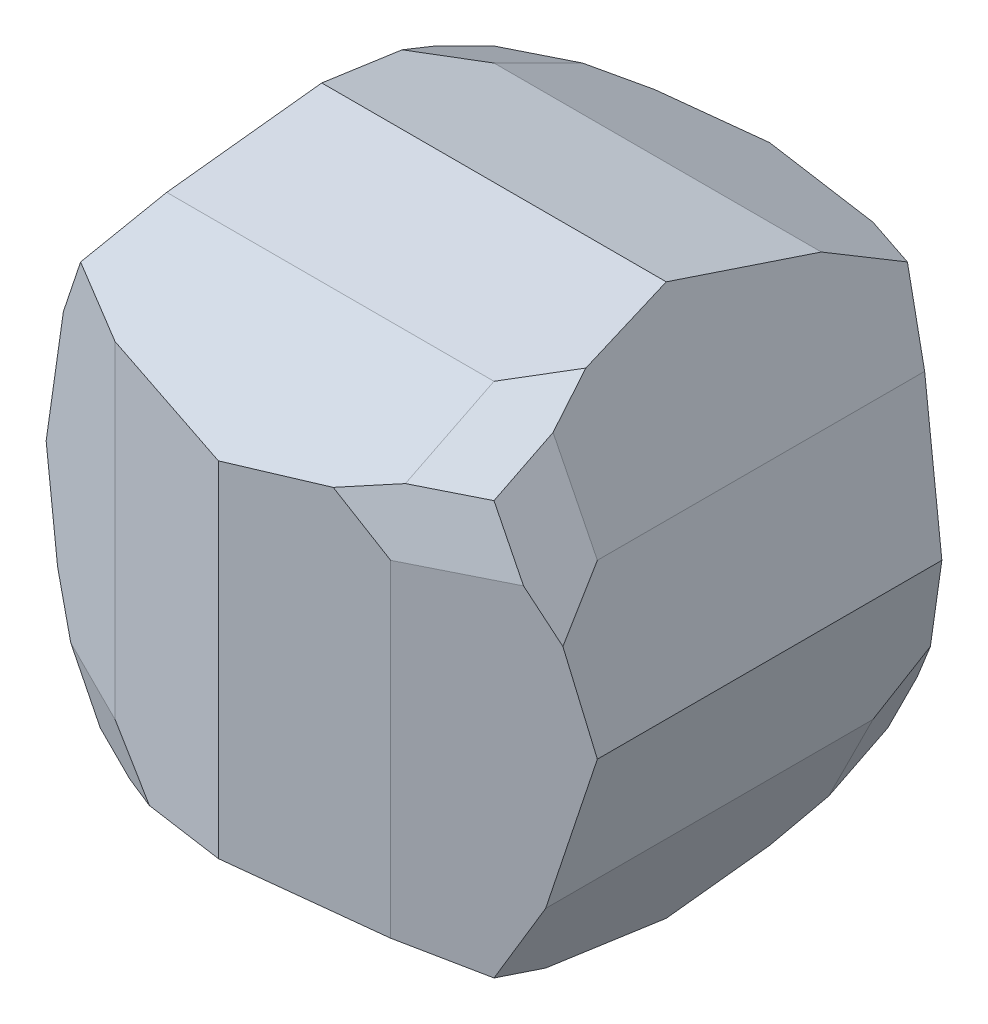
ISO-10303-21;
HEADER;
FILE_DESCRIPTION(('STEP AP214'),'2;1');
FILE_NAME('part.step','',(''),(''),'','','');
FILE_SCHEMA(('AUTOMOTIVE_DESIGN { 1 0 10303 214 1 1 1 1 }'));
ENDSEC;
DATA;
#1=APPLICATION_CONTEXT('core data for automotive mechanical design processes');
#2=APPLICATION_PROTOCOL_DEFINITION('international standard','automotive_design',2000,#1);
#3=PRODUCT_CONTEXT('',#1,'mechanical');
#4=PRODUCT('Part','Part','',(#3));
#5=PRODUCT_RELATED_PRODUCT_CATEGORY('part','',(#4));
#6=PRODUCT_DEFINITION_FORMATION('','',#4);
#7=PRODUCT_DEFINITION_CONTEXT('part definition',#1,'design');
#8=PRODUCT_DEFINITION('design','',#6,#7);
#9=PRODUCT_DEFINITION_SHAPE('','',#8);
#10=(LENGTH_UNIT() NAMED_UNIT(*) SI_UNIT(.MILLI.,.METRE.));
#11=(NAMED_UNIT(*) PLANE_ANGLE_UNIT() SI_UNIT($,.RADIAN.));
#12=(NAMED_UNIT(*) SI_UNIT($,.STERADIAN.) SOLID_ANGLE_UNIT());
#13=UNCERTAINTY_MEASURE_WITH_UNIT(LENGTH_MEASURE(1.E-05),#10,'distance_accuracy_value','');
#14=(GEOMETRIC_REPRESENTATION_CONTEXT(3) GLOBAL_UNCERTAINTY_ASSIGNED_CONTEXT((#13)) GLOBAL_UNIT_ASSIGNED_CONTEXT((#10,
#11,#12)) REPRESENTATION_CONTEXT('',''));
#15=CARTESIAN_POINT('',(0.,0.,0.));
#16=DIRECTION('',(0.,0.,1.));
#17=DIRECTION('',(1.,0.,0.));
#18=AXIS2_PLACEMENT_3D('',#15,#16,#17);
#19=CARTESIAN_POINT('',(-19.9999999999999,-20.0000000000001,0.));
#20=DIRECTION('',(-0.218217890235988,-0.872871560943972,0.436435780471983));
#21=DIRECTION('',(0.,0.447213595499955,0.894427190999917));
#22=AXIS2_PLACEMENT_3D('',#19,#20,#21);
#23=PLANE('',#22);
#24=DIRECTION('',(0.894427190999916,0.,0.447213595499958));
#25=VECTOR('',#24,1.);
#26=CARTESIAN_POINT('',(-0.571428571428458,-14.2857142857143,21.1428571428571));
#27=LINE('',#26,#25);
#28=CARTESIAN_POINT('',(-14.2857142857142,-14.2857142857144,14.2857142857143));
#29=VERTEX_POINT('',#28);
#30=CARTESIAN_POINT('',(-9.99999999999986,-14.2857142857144,16.4285714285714));
#31=VERTEX_POINT('',#30);
#32=EDGE_CURVE('E356',#29,#31,#27,.T.);
#33=ORIENTED_EDGE('',*,*,#32,.F.);
#34=DIRECTION('',(0.,-0.447213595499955,-0.894427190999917));
#35=VECTOR('',#34,1.);
#36=CARTESIAN_POINT('',(-14.2857142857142,-21.1428571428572,0.571428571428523));
#37=LINE('',#36,#35);
#38=CARTESIAN_POINT('',(-14.2857142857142,-16.4285714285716,9.99999999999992));
#39=VERTEX_POINT('',#38);
#40=EDGE_CURVE('E473',#29,#39,#37,.T.);
#41=ORIENTED_EDGE('',*,*,#40,.T.);
#42=DIRECTION('',(0.240771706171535,-0.481543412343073,-0.842700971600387));
#43=VECTOR('',#42,1.);
#44=CARTESIAN_POINT('',(-12.1739130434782,-20.6521739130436,2.60869565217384));
#45=LINE('',#44,#43);
#46=CARTESIAN_POINT('',(-13.3333333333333,-18.3333333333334,6.66666666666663));
#47=VERTEX_POINT('',#46);
#48=EDGE_CURVE('E357',#39,#47,#45,.T.);
#49=ORIENTED_EDGE('',*,*,#48,.T.);
#50=DIRECTION('',(-0.696310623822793,-0.174077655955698,-0.69631062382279));
#51=VECTOR('',#50,1.);
#52=CARTESIAN_POINT('',(-19.9999999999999,-20.0000000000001,0.));
#53=LINE('',#52,#51);
#54=CARTESIAN_POINT('',(-9.9999999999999,-17.5000000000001,9.99999999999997));
#55=VERTEX_POINT('',#54);
#56=EDGE_CURVE('E385',#55,#47,#53,.T.);
#57=ORIENTED_EDGE('',*,*,#56,.F.);
#58=DIRECTION('',(0.,-0.447213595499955,-0.894427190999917));
#59=VECTOR('',#58,1.);
#60=CARTESIAN_POINT('',(-9.99999999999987,-12.5000000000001,20.0000000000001));
#61=LINE('',#60,#59);
#62=EDGE_CURVE('E384',#31,#55,#61,.T.);
#63=ORIENTED_EDGE('',*,*,#62,.F.);
#64=EDGE_LOOP('',(#33,#41,#49,#57,#63));
#65=FACE_BOUND('',#64,.T.);
#66=ADVANCED_FACE('F57',(#65),#23,.T.);
#67=CARTESIAN_POINT('',(1.36189806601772E-13,-20.,20.));
#68=DIRECTION('',(-0.436435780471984,-0.218217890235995,0.872871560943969));
#69=DIRECTION('',(-0.894427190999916,0.,-0.447213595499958));
#70=AXIS2_PLACEMENT_3D('',#67,#68,#69);
#71=PLANE('',#70);
#72=DIRECTION('',(0.894427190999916,0.,0.447213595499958));
#73=VECTOR('',#72,1.);
#74=CARTESIAN_POINT('',(-20.,-10.0000000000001,12.5));
#75=LINE('',#74,#73);
#76=CARTESIAN_POINT('',(-16.4285714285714,-10.0000000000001,14.2857142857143));
#77=VERTEX_POINT('',#76);
#78=CARTESIAN_POINT('',(-9.99999999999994,-10.0000000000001,17.5));
#79=VERTEX_POINT('',#78);
#80=EDGE_CURVE('E389',#77,#79,#75,.T.);
#81=ORIENTED_EDGE('',*,*,#80,.F.);
#82=DIRECTION('',(0.44721359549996,-0.894427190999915,0.));
#83=VECTOR('',#82,1.);
#84=CARTESIAN_POINT('',(-9.14285714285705,-24.5714285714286,14.2857142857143));
#85=LINE('',#84,#83);
#86=EDGE_CURVE('E483',#77,#29,#85,.T.);
#87=ORIENTED_EDGE('',*,*,#86,.T.);
#88=ORIENTED_EDGE('',*,*,#32,.T.);
#89=DIRECTION('',(0.842700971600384,0.240771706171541,0.481543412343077));
#90=VECTOR('',#89,1.);
#91=CARTESIAN_POINT('',(-2.60869565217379,-12.1739130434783,20.6521739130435));
#92=LINE('',#91,#90);
#93=CARTESIAN_POINT('',(-6.66666666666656,-13.3333333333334,18.3333333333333));
#94=VERTEX_POINT('',#93);
#95=EDGE_CURVE('E480',#31,#94,#92,.T.);
#96=ORIENTED_EDGE('',*,*,#95,.T.);
#97=DIRECTION('',(0.696310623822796,-0.696310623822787,0.174077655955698));
#98=VECTOR('',#97,1.);
#99=CARTESIAN_POINT('',(1.27831593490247E-13,-20.,20.));
#100=LINE('',#99,#98);
#101=EDGE_CURVE('E390',#79,#94,#100,.T.);
#102=ORIENTED_EDGE('',*,*,#101,.F.);
#103=EDGE_LOOP('',(#81,#87,#88,#96,#102));
#104=FACE_BOUND('',#103,.T.);
#105=ADVANCED_FACE('F685',(#104),#71,.T.);
#106=CARTESIAN_POINT('',(-19.9999999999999,-1.33136693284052E-13,20.0000000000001));
#107=DIRECTION('',(-0.872871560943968,-0.436435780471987,0.218217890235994));
#108=DIRECTION('',(0.447213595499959,-0.894427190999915,0.));
#109=AXIS2_PLACEMENT_3D('',#106,#107,#108);
#110=PLANE('',#109);
#111=DIRECTION('',(0.48154341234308,-0.842700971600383,0.240771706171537));
#112=VECTOR('',#111,1.);
#113=CARTESIAN_POINT('',(-29.6376811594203,13.1159420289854,7.68115942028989));
#114=LINE('',#113,#112);
#115=CARTESIAN_POINT('',(-18.3333333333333,-6.66666666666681,13.3333333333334));
#116=VERTEX_POINT('',#115);
#117=EDGE_CURVE('E485',#116,#77,#114,.T.);
#118=ORIENTED_EDGE('',*,*,#117,.F.);
#119=DIRECTION('',(-0.174077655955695,0.696310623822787,0.696310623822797));
#120=VECTOR('',#119,1.);
#121=CARTESIAN_POINT('',(-19.9999999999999,-1.41494906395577E-13,20.0000000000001));
#122=LINE('',#121,#120);
#123=CARTESIAN_POINT('',(-17.4999999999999,-10.0000000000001,10.));
#124=VERTEX_POINT('',#123);
#125=EDGE_CURVE('E450',#124,#116,#122,.T.);
#126=ORIENTED_EDGE('',*,*,#125,.F.);
#127=DIRECTION('',(-0.447213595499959,0.894427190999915,0.));
#128=VECTOR('',#127,1.);
#129=CARTESIAN_POINT('',(-12.4999999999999,-20.0000000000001,9.99999999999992));
#130=LINE('',#129,#128);
#131=EDGE_CURVE('E495',#39,#124,#130,.T.);
#132=ORIENTED_EDGE('',*,*,#131,.F.);
#133=ORIENTED_EDGE('',*,*,#40,.F.);
#134=ORIENTED_EDGE('',*,*,#86,.F.);
#135=EDGE_LOOP('',(#118,#126,#132,#133,#134));
#136=FACE_BOUND('',#135,.T.);
#137=ADVANCED_FACE('F693',(#136),#110,.T.);
#138=CARTESIAN_POINT('',(-19.9999999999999,-1.31401969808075E-13,20.0000000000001));
#139=DIRECTION('',(-0.970142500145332,-0.242535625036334,0.));
#140=DIRECTION('',(0.242535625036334,-0.970142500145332,0.));
#141=AXIS2_PLACEMENT_3D('',#138,#139,#140);
#142=PLANE('',#141);
#143=DIRECTION('',(-0.240771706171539,0.963086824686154,0.12038585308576));
#144=VECTOR('',#143,1.);
#145=CARTESIAN_POINT('',(-15.3623188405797,-18.5507246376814,-14.81884057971));
#146=LINE('',#145,#144);
#147=CARTESIAN_POINT('',(-17.5000000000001,-9.99999999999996,-13.7499999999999));
#148=VERTEX_POINT('',#147);
#149=CARTESIAN_POINT('',(-20.,-1.15923984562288E-13,-12.5));
#150=VERTEX_POINT('',#149);
#151=EDGE_CURVE('E152',#148,#150,#146,.T.);
#152=ORIENTED_EDGE('',*,*,#151,.F.);
#153=DIRECTION('',(0.,0.,-1.));
#154=VECTOR('',#153,1.);
#155=CARTESIAN_POINT('',(-17.5000000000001,-9.99999999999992,-20.));
#156=LINE('',#155,#154);
#157=EDGE_CURVE('E492',#124,#148,#156,.T.);
#158=ORIENTED_EDGE('',*,*,#157,.F.);
#159=ORIENTED_EDGE('',*,*,#125,.T.);
#160=DIRECTION('',(0.24077170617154,-0.963086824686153,0.120385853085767));
#161=VECTOR('',#160,1.);
#162=CARTESIAN_POINT('',(-24.6376811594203,18.5507246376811,10.1811594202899));
#163=LINE('',#162,#161);
#164=CARTESIAN_POINT('',(-20.0000000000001,-3.8740803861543E-13,12.5));
#165=VERTEX_POINT('',#164);
#166=EDGE_CURVE('E466',#165,#116,#163,.T.);
#167=ORIENTED_EDGE('',*,*,#166,.F.);
#168=DIRECTION('',(0.,0.,-1.));
#169=VECTOR('',#168,1.);
#170=CARTESIAN_POINT('',(-20.,-2.51653001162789E-13,-1.59872115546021E-13));
#171=LINE('',#170,#169);
#172=EDGE_CURVE('E309',#165,#150,#171,.T.);
#173=ORIENTED_EDGE('',*,*,#172,.T.);
#174=EDGE_LOOP('',(#152,#158,#159,#167,#173));
#175=FACE_BOUND('',#174,.T.);
#176=ADVANCED_FACE('F736',(#175),#142,.T.);
#177=CARTESIAN_POINT('',(-1.43128700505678E-13,19.9999999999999,-20.0000000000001));
#178=DIRECTION('',(-0.436435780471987,0.218217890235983,-0.872871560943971));
#179=DIRECTION('',(-0.894427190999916,0.,0.447213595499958));
#180=AXIS2_PLACEMENT_3D('',#177,#178,#179);
#181=PLANE('',#180);
#182=DIRECTION('',(0.894427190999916,0.,-0.447213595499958));
#183=VECTOR('',#182,1.);
#184=CARTESIAN_POINT('',(-20.0000000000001,9.99999999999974,-12.5));
#185=LINE('',#184,#183);
#186=CARTESIAN_POINT('',(-16.4285714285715,9.99999999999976,-14.2857142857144));
#187=VERTEX_POINT('',#186);
#188=CARTESIAN_POINT('',(-10.0000000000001,9.99999999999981,-17.5000000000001));
#189=VERTEX_POINT('',#188);
#190=EDGE_CURVE('E379',#187,#189,#185,.T.);
#191=ORIENTED_EDGE('',*,*,#190,.F.);
#192=DIRECTION('',(0.447213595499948,0.894427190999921,0.));
#193=VECTOR('',#192,1.);
#194=CARTESIAN_POINT('',(-9.14285714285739,24.5714285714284,-14.2857142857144));
#195=LINE('',#194,#193);
#196=CARTESIAN_POINT('',(-14.2857142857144,14.2857142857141,-14.2857142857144));
#197=VERTEX_POINT('',#196);
#198=EDGE_CURVE('E509',#187,#197,#195,.T.);
#199=ORIENTED_EDGE('',*,*,#198,.T.);
#200=DIRECTION('',(0.894427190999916,0.,-0.447213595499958));
#201=VECTOR('',#200,1.);
#202=CARTESIAN_POINT('',(-0.571428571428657,14.2857142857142,-21.1428571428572));
#203=LINE('',#202,#201);
#204=CARTESIAN_POINT('',(-10.0000000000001,14.2857142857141,-16.4285714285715));
#205=VERTEX_POINT('',#204);
#206=EDGE_CURVE('E503',#197,#205,#203,.T.);
#207=ORIENTED_EDGE('',*,*,#206,.T.);
#208=DIRECTION('',(0.842700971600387,-0.240771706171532,-0.481543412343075));
#209=VECTOR('',#208,1.);
#210=CARTESIAN_POINT('',(-2.60869565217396,12.1739130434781,-20.6521739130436));
#211=LINE('',#210,#209);
#212=CARTESIAN_POINT('',(-6.66666666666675,13.3333333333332,-18.3333333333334));
#213=VERTEX_POINT('',#212);
#214=EDGE_CURVE('E506',#205,#213,#211,.T.);
#215=ORIENTED_EDGE('',*,*,#214,.T.);
#216=DIRECTION('',(0.696310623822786,0.696310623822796,-0.174077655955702));
#217=VECTOR('',#216,1.);
#218=CARTESIAN_POINT('',(-1.51486913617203E-13,19.9999999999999,-20.0000000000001));
#219=LINE('',#218,#217);
#220=EDGE_CURVE('E380',#189,#213,#219,.T.);
#221=ORIENTED_EDGE('',*,*,#220,.F.);
#222=EDGE_LOOP('',(#191,#199,#207,#215,#221));
#223=FACE_BOUND('',#222,.T.);
#224=ADVANCED_FACE('F642',(#223),#181,.T.);
#225=CARTESIAN_POINT('',(-20.0000000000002,19.9999999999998,-1.23144686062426E-13));
#226=DIRECTION('',(-0.218217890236,0.872871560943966,-0.436435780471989));
#227=DIRECTION('',(0.,-0.447213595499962,-0.894427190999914));
#228=AXIS2_PLACEMENT_3D('',#225,#226,#227);
#229=PLANE('',#228);
#230=ORIENTED_EDGE('',*,*,#206,.F.);
#231=DIRECTION('',(0.,0.447213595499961,0.894427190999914));
#232=VECTOR('',#231,1.);
#233=CARTESIAN_POINT('',(-14.2857142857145,21.142857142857,-0.571428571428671));
#234=LINE('',#233,#232);
#235=CARTESIAN_POINT('',(-14.2857142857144,16.4285714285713,-10.));
#236=VERTEX_POINT('',#235);
#237=EDGE_CURVE('E497',#197,#236,#234,.T.);
#238=ORIENTED_EDGE('',*,*,#237,.T.);
#239=DIRECTION('',(0.240771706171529,0.481543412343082,0.842700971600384));
#240=VECTOR('',#239,1.);
#241=CARTESIAN_POINT('',(-12.1739130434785,20.6521739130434,-2.60869565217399));
#242=LINE('',#241,#240);
#243=CARTESIAN_POINT('',(-13.3333333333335,18.3333333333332,-6.66666666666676));
#244=VERTEX_POINT('',#243);
#245=EDGE_CURVE('E500',#236,#244,#242,.T.);
#246=ORIENTED_EDGE('',*,*,#245,.T.);
#247=DIRECTION('',(-0.696310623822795,0.174077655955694,0.696310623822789));
#248=VECTOR('',#247,1.);
#249=CARTESIAN_POINT('',(-20.0000000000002,19.9999999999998,-1.3150289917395E-13));
#250=LINE('',#249,#248);
#251=CARTESIAN_POINT('',(-10.0000000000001,17.4999999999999,-10.0000000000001));
#252=VERTEX_POINT('',#251);
#253=EDGE_CURVE('E375',#252,#244,#250,.T.);
#254=ORIENTED_EDGE('',*,*,#253,.F.);
#255=DIRECTION('',(0.,0.447213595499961,0.894427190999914));
#256=VECTOR('',#255,1.);
#257=CARTESIAN_POINT('',(-10.,12.4999999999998,-20.0000000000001));
#258=LINE('',#257,#256);
#259=EDGE_CURVE('E374',#205,#252,#258,.T.);
#260=ORIENTED_EDGE('',*,*,#259,.F.);
#261=EDGE_LOOP('',(#230,#238,#246,#254,#260));
#262=FACE_BOUND('',#261,.T.);
#263=ADVANCED_FACE('F645',(#262),#229,.T.);
#264=CARTESIAN_POINT('',(-19.9999999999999,-2.85841067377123E-13,-20.0000000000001));
#265=DIRECTION('',(-0.872871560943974,0.436435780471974,-0.218217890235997));
#266=DIRECTION('',(0.447213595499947,0.894427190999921,0.));
#267=AXIS2_PLACEMENT_3D('',#264,#265,#266);
#268=PLANE('',#267);
#269=DIRECTION('',(0.481543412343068,0.842700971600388,-0.240771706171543));
#270=VECTOR('',#269,1.);
#271=CARTESIAN_POINT('',(-29.6376811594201,-13.1159420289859,-7.6811594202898));
#272=LINE('',#271,#270);
#273=CARTESIAN_POINT('',(-18.3333333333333,6.66666666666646,-13.3333333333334));
#274=VERTEX_POINT('',#273);
#275=EDGE_CURVE('E465',#274,#187,#272,.T.);
#276=ORIENTED_EDGE('',*,*,#275,.F.);
#277=DIRECTION('',(-0.174077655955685,-0.696310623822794,-0.696310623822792));
#278=VECTOR('',#277,1.);
#279=CARTESIAN_POINT('',(-19.9999999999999,-2.77482854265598E-13,-20.0000000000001));
#280=LINE('',#279,#278);
#281=CARTESIAN_POINT('',(-17.5000000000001,9.99999999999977,-10.0000000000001));
#282=VERTEX_POINT('',#281);
#283=EDGE_CURVE('E446',#282,#274,#280,.T.);
#284=ORIENTED_EDGE('',*,*,#283,.F.);
#285=DIRECTION('',(-0.447213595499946,-0.894427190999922,0.));
#286=VECTOR('',#285,1.);
#287=CARTESIAN_POINT('',(-12.5000000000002,19.9999999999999,-10.0000000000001));
#288=LINE('',#287,#286);
#289=EDGE_CURVE('E370',#236,#282,#288,.T.);
#290=ORIENTED_EDGE('',*,*,#289,.F.);
#291=ORIENTED_EDGE('',*,*,#237,.F.);
#292=ORIENTED_EDGE('',*,*,#198,.F.);
#293=EDGE_LOOP('',(#276,#284,#290,#291,#292));
#294=FACE_BOUND('',#293,.T.);
#295=ADVANCED_FACE('F528',(#294),#268,.T.);
#296=CARTESIAN_POINT('',(-19.9999999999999,-2.875757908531E-13,-20.0000000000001));
#297=DIRECTION('',(-0.970142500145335,0.242535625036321,0.));
#298=DIRECTION('',(0.24253562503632,0.970142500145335,0.));
#299=AXIS2_PLACEMENT_3D('',#296,#297,#298);
#300=PLANE('',#299);
#301=ORIENTED_EDGE('',*,*,#172,.F.);
#302=DIRECTION('',(0.240771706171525,0.963086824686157,0.120385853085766));
#303=VECTOR('',#302,1.);
#304=CARTESIAN_POINT('',(-20.9420289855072,-3.76811594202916,12.0289855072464));
#305=LINE('',#304,#303);
#306=CARTESIAN_POINT('',(-17.5000000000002,9.99999999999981,13.7499999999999));
#307=VERTEX_POINT('',#306);
#308=EDGE_CURVE('E160',#165,#307,#305,.T.);
#309=ORIENTED_EDGE('',*,*,#308,.T.);
#310=DIRECTION('',(0.,0.,1.));
#311=VECTOR('',#310,1.);
#312=CARTESIAN_POINT('',(-17.5000000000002,9.99999999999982,19.9999999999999));
#313=LINE('',#312,#311);
#314=EDGE_CURVE('E449',#282,#307,#313,.T.);
#315=ORIENTED_EDGE('',*,*,#314,.F.);
#316=ORIENTED_EDGE('',*,*,#283,.T.);
#317=DIRECTION('',(0.240771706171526,0.963086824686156,-0.120385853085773));
#318=VECTOR('',#317,1.);
#319=CARTESIAN_POINT('',(-24.63768115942,-18.5507246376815,-10.1811594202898));
#320=LINE('',#319,#318);
#321=EDGE_CURVE('E462',#150,#274,#320,.T.);
#322=ORIENTED_EDGE('',*,*,#321,.F.);
#323=EDGE_LOOP('',(#301,#309,#315,#316,#322));
#324=FACE_BOUND('',#323,.T.);
#325=ADVANCED_FACE('F525',(#324),#300,.T.);
#326=CARTESIAN_POINT('',(20.0000000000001,-12.5,19.9999999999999));
#327=DIRECTION('',(0.,-0.894427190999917,0.447213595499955));
#328=DIRECTION('',(0.,0.447213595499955,0.894427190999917));
#329=AXIS2_PLACEMENT_3D('',#326,#327,#328);
#330=PLANE('',#329);
#331=DIRECTION('',(1.,0.,0.));
#332=VECTOR('',#331,1.);
#333=CARTESIAN_POINT('',(20.0000000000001,-17.4999999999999,9.99999999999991));
#334=LINE('',#333,#332);
#335=CARTESIAN_POINT('',(13.7500000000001,-17.5,9.99999999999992));
#336=VERTEX_POINT('',#335);
#337=EDGE_CURVE('E381',#55,#336,#334,.T.);
#338=ORIENTED_EDGE('',*,*,#337,.T.);
#339=DIRECTION('',(0.218217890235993,0.436435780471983,0.87287156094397));
#340=VECTOR('',#339,1.);
#341=CARTESIAN_POINT('',(16.4285714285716,-12.1428571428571,20.7142857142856));
#342=LINE('',#341,#340);
#343=CARTESIAN_POINT('',(15.0000000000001,-15.,14.9999999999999));
#344=VERTEX_POINT('',#343);
#345=EDGE_CURVE('E414',#336,#344,#342,.T.);
#346=ORIENTED_EDGE('',*,*,#345,.T.);
#347=DIRECTION('',(-0.872871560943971,0.218217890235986,0.436435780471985));
#348=VECTOR('',#347,1.);
#349=CARTESIAN_POINT('',(16.4285714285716,-15.3571428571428,14.2857142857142));
#350=LINE('',#349,#348);
#351=CARTESIAN_POINT('',(10.,-13.75,17.5));
#352=VERTEX_POINT('',#351);
#353=EDGE_CURVE('E330',#344,#352,#350,.T.);
#354=ORIENTED_EDGE('',*,*,#353,.T.);
#355=DIRECTION('',(-0.963086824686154,0.120385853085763,0.240771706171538));
#356=VECTOR('',#355,1.);
#357=CARTESIAN_POINT('',(18.5507246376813,-14.8188405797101,15.3623188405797));
#358=LINE('',#357,#356);
#359=CARTESIAN_POINT('',(1.31453093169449E-13,-12.5,20.0000000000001));
#360=VERTEX_POINT('',#359);
#361=EDGE_CURVE('E224',#352,#360,#358,.T.);
#362=ORIENTED_EDGE('',*,*,#361,.T.);
#363=DIRECTION('',(0.963086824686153,0.120385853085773,0.240771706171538));
#364=VECTOR('',#363,1.);
#365=CARTESIAN_POINT('',(-0.869565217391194,-12.608695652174,19.7826086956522));
#366=LINE('',#365,#364);
#367=EDGE_CURVE('E432',#94,#360,#366,.T.);
#368=ORIENTED_EDGE('',*,*,#367,.F.);
#369=ORIENTED_EDGE('',*,*,#95,.F.);
#370=ORIENTED_EDGE('',*,*,#62,.T.);
#371=EDGE_LOOP('',(#338,#346,#354,#362,#368,#369,#370));
#372=FACE_BOUND('',#371,.T.);
#373=ADVANCED_FACE('F683',(#372),#330,.T.);
#374=CARTESIAN_POINT('',(-19.9999999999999,-20.0000000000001,0.));
#375=DIRECTION('',(0.,-0.970142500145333,0.24253562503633));
#376=DIRECTION('',(0.,0.24253562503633,0.970142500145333));
#377=AXIS2_PLACEMENT_3D('',#374,#375,#376);
#378=PLANE('',#377);
#379=DIRECTION('',(-1.,0.,0.));
#380=VECTOR('',#379,1.);
#381=CARTESIAN_POINT('',(0.,-20.,0.));
#382=LINE('',#381,#380);
#383=CARTESIAN_POINT('',(12.5000000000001,-20.,-2.42193418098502E-13));
#384=VERTEX_POINT('',#383);
#385=CARTESIAN_POINT('',(-12.5,-20.0000000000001,0.));
#386=VERTEX_POINT('',#385);
#387=EDGE_CURVE('E308',#384,#386,#382,.T.);
#388=ORIENTED_EDGE('',*,*,#387,.F.);
#389=DIRECTION('',(0.120385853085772,0.240771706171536,0.963086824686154));
#390=VECTOR('',#389,1.);
#391=CARTESIAN_POINT('',(12.0289855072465,-20.9420289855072,-3.76811594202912));
#392=LINE('',#391,#390);
#393=EDGE_CURVE('E331',#384,#336,#392,.T.);
#394=ORIENTED_EDGE('',*,*,#393,.T.);
#395=ORIENTED_EDGE('',*,*,#337,.F.);
#396=ORIENTED_EDGE('',*,*,#56,.T.);
#397=DIRECTION('',(0.120385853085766,-0.240771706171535,-0.963086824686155));
#398=VECTOR('',#397,1.);
#399=CARTESIAN_POINT('',(-12.6086956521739,-19.7826086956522,0.869565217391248));
#400=LINE('',#399,#398);
#401=EDGE_CURVE('E352',#47,#386,#400,.T.);
#402=ORIENTED_EDGE('',*,*,#401,.T.);
#403=EDGE_LOOP('',(#388,#394,#395,#396,#402));
#404=FACE_BOUND('',#403,.T.);
#405=ADVANCED_FACE('F702',(#404),#378,.T.);
#406=CARTESIAN_POINT('',(-12.5000000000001,-19.9999999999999,-20.));
#407=DIRECTION('',(-0.894427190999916,-0.447213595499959,0.));
#408=DIRECTION('',(0.447213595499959,-0.894427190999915,0.));
#409=AXIS2_PLACEMENT_3D('',#406,#407,#408);
#410=PLANE('',#409);
#411=DIRECTION('',(0.218217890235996,-0.436435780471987,0.872871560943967));
#412=VECTOR('',#411,1.);
#413=CARTESIAN_POINT('',(-15.3571428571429,-14.2857142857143,-16.4285714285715));
#414=LINE('',#413,#412);
#415=CARTESIAN_POINT('',(-15.,-15.0000000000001,-14.9999999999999));
#416=VERTEX_POINT('',#415);
#417=CARTESIAN_POINT('',(-13.75,-17.5,-10.));
#418=VERTEX_POINT('',#417);
#419=EDGE_CURVE('E410',#416,#418,#414,.T.);
#420=ORIENTED_EDGE('',*,*,#419,.T.);
#421=DIRECTION('',(0.120385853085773,-0.240771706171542,0.963086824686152));
#422=VECTOR('',#421,1.);
#423=CARTESIAN_POINT('',(-14.8188405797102,-15.3623188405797,-18.5507246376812));
#424=LINE('',#423,#422);
#425=EDGE_CURVE('E413',#418,#386,#424,.T.);
#426=ORIENTED_EDGE('',*,*,#425,.T.);
#427=ORIENTED_EDGE('',*,*,#401,.F.);
#428=ORIENTED_EDGE('',*,*,#48,.F.);
#429=ORIENTED_EDGE('',*,*,#131,.T.);
#430=ORIENTED_EDGE('',*,*,#157,.T.);
#431=DIRECTION('',(-0.436435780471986,0.872871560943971,0.218217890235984));
#432=VECTOR('',#431,1.);
#433=CARTESIAN_POINT('',(-14.2857142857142,-16.4285714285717,-15.3571428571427));
#434=LINE('',#433,#432);
#435=EDGE_CURVE('E368',#416,#148,#434,.T.);
#436=ORIENTED_EDGE('',*,*,#435,.F.);
#437=EDGE_LOOP('',(#420,#426,#427,#428,#429,#430,#436));
#438=FACE_BOUND('',#437,.T.);
#439=ADVANCED_FACE('F698',(#438),#410,.T.);
#440=CARTESIAN_POINT('',(1.37924530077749E-13,-20.,20.));
#441=DIRECTION('',(-0.242535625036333,0.,0.970142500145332));
#442=DIRECTION('',(-0.970142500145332,0.,-0.242535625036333));
#443=AXIS2_PLACEMENT_3D('',#440,#441,#442);
#444=PLANE('',#443);
#445=DIRECTION('',(0.,-1.,0.));
#446=VECTOR('',#445,1.);
#447=CARTESIAN_POINT('',(0.,0.,20.));
#448=LINE('',#447,#446);
#449=CARTESIAN_POINT('',(0.,12.5000000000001,20.));
#450=VERTEX_POINT('',#449);
#451=EDGE_CURVE('E305',#450,#360,#448,.T.);
#452=ORIENTED_EDGE('',*,*,#451,.F.);
#453=DIRECTION('',(-0.963086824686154,0.12038585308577,-0.240771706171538));
#454=VECTOR('',#453,1.);
#455=CARTESIAN_POINT('',(3.76811594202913,12.0289855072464,20.9420289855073));
#456=LINE('',#455,#454);
#457=CARTESIAN_POINT('',(-10.0000000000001,13.75,17.5));
#458=VERTEX_POINT('',#457);
#459=EDGE_CURVE('E409',#450,#458,#456,.T.);
#460=ORIENTED_EDGE('',*,*,#459,.T.);
#461=DIRECTION('',(0.,1.,0.));
#462=VECTOR('',#461,1.);
#463=CARTESIAN_POINT('',(-10.0000000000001,19.9999999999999,17.5));
#464=LINE('',#463,#462);
#465=EDGE_CURVE('E386',#79,#458,#464,.T.);
#466=ORIENTED_EDGE('',*,*,#465,.F.);
#467=ORIENTED_EDGE('',*,*,#101,.T.);
#468=ORIENTED_EDGE('',*,*,#367,.T.);
#469=EDGE_LOOP('',(#452,#460,#466,#467,#468));
#470=FACE_BOUND('',#469,.T.);
#471=ADVANCED_FACE('F678',(#470),#444,.T.);
#472=CARTESIAN_POINT('',(-20.0000000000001,19.9999999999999,12.5));
#473=DIRECTION('',(-0.447213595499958,0.,0.894427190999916));
#474=DIRECTION('',(-0.894427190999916,0.,-0.447213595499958));
#475=AXIS2_PLACEMENT_3D('',#472,#473,#474);
#476=PLANE('',#475);
#477=ORIENTED_EDGE('',*,*,#465,.T.);
#478=DIRECTION('',(-0.87287156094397,0.218217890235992,-0.436435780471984));
#479=VECTOR('',#478,1.);
#480=CARTESIAN_POINT('',(-20.7142857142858,16.4285714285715,12.1428571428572));
#481=LINE('',#480,#479);
#482=CARTESIAN_POINT('',(-15.0000000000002,15.0000000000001,15.));
#483=VERTEX_POINT('',#482);
#484=EDGE_CURVE('E406',#458,#483,#481,.T.);
#485=ORIENTED_EDGE('',*,*,#484,.T.);
#486=DIRECTION('',(0.436435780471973,0.872871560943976,0.218217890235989));
#487=VECTOR('',#486,1.);
#488=CARTESIAN_POINT('',(-12.1428571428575,20.7142857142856,16.4285714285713));
#489=LINE('',#488,#487);
#490=EDGE_CURVE('E365',#307,#483,#489,.T.);
#491=ORIENTED_EDGE('',*,*,#490,.F.);
#492=ORIENTED_EDGE('',*,*,#308,.F.);
#493=ORIENTED_EDGE('',*,*,#166,.T.);
#494=ORIENTED_EDGE('',*,*,#117,.T.);
#495=ORIENTED_EDGE('',*,*,#80,.T.);
#496=EDGE_LOOP('',(#477,#485,#491,#492,#493,#494,#495));
#497=FACE_BOUND('',#496,.T.);
#498=ADVANCED_FACE('F734',(#497),#476,.T.);
#499=CARTESIAN_POINT('',(19.9999999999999,12.5000000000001,-20.));
#500=DIRECTION('',(0.,0.894427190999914,-0.447213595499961));
#501=DIRECTION('',(0.,-0.447213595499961,-0.894427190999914));
#502=AXIS2_PLACEMENT_3D('',#499,#500,#501);
#503=PLANE('',#502);
#504=DIRECTION('',(-0.872871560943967,-0.218217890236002,-0.436435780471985));
#505=VECTOR('',#504,1.);
#506=CARTESIAN_POINT('',(16.4285714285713,15.357142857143,-14.2857142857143));
#507=LINE('',#506,#505);
#508=CARTESIAN_POINT('',(15.,15.0000000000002,-14.9999999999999));
#509=VERTEX_POINT('',#508);
#510=CARTESIAN_POINT('',(10.,13.7500000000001,-17.4999999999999));
#511=VERTEX_POINT('',#510);
#512=EDGE_CURVE('E399',#509,#511,#507,.T.);
#513=ORIENTED_EDGE('',*,*,#512,.T.);
#514=DIRECTION('',(-0.963086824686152,-0.120385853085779,-0.240771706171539));
#515=VECTOR('',#514,1.);
#516=CARTESIAN_POINT('',(18.550724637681,14.8188405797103,-15.3623188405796));
#517=LINE('',#516,#515);
#518=CARTESIAN_POINT('',(-2.47879059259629E-13,12.4999999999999,-20.));
#519=VERTEX_POINT('',#518);
#520=EDGE_CURVE('E402',#511,#519,#517,.T.);
#521=ORIENTED_EDGE('',*,*,#520,.T.);
#522=DIRECTION('',(0.963086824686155,-0.120385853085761,-0.240771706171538));
#523=VECTOR('',#522,1.);
#524=CARTESIAN_POINT('',(-0.86956521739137,12.6086956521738,-19.7826086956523));
#525=LINE('',#524,#523);
#526=EDGE_CURVE('E511',#213,#519,#525,.T.);
#527=ORIENTED_EDGE('',*,*,#526,.F.);
#528=ORIENTED_EDGE('',*,*,#214,.F.);
#529=ORIENTED_EDGE('',*,*,#259,.T.);
#530=DIRECTION('',(1.,0.,0.));
#531=VECTOR('',#530,1.);
#532=CARTESIAN_POINT('',(19.9999999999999,17.5000000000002,-10.));
#533=LINE('',#532,#531);
#534=CARTESIAN_POINT('',(13.75,17.5000000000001,-10.));
#535=VERTEX_POINT('',#534);
#536=EDGE_CURVE('E371',#252,#535,#533,.T.);
#537=ORIENTED_EDGE('',*,*,#536,.T.);
#538=DIRECTION('',(0.218217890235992,-0.436435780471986,-0.872871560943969));
#539=VECTOR('',#538,1.);
#540=CARTESIAN_POINT('',(16.4285714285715,12.1428571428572,-20.7142857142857));
#541=LINE('',#540,#539);
#542=EDGE_CURVE('E403',#535,#509,#541,.T.);
#543=ORIENTED_EDGE('',*,*,#542,.T.);
#544=EDGE_LOOP('',(#513,#521,#527,#528,#529,#537,#543));
#545=FACE_BOUND('',#544,.T.);
#546=ADVANCED_FACE('F640',(#545),#503,.T.);
#547=CARTESIAN_POINT('',(-1.41393977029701E-13,19.9999999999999,-20.0000000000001));
#548=DIRECTION('',(-0.242535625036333,0.,-0.970142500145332));
#549=DIRECTION('',(-0.970142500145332,0.,0.242535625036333));
#550=AXIS2_PLACEMENT_3D('',#547,#548,#549);
#551=PLANE('',#550);
#552=DIRECTION('',(0.,1.,0.));
#553=VECTOR('',#552,1.);
#554=CARTESIAN_POINT('',(0.,0.,-20.));
#555=LINE('',#554,#553);
#556=CARTESIAN_POINT('',(2.40940165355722E-13,-12.5,-20.));
#557=VERTEX_POINT('',#556);
#558=EDGE_CURVE('E313',#557,#519,#555,.T.);
#559=ORIENTED_EDGE('',*,*,#558,.F.);
#560=DIRECTION('',(-0.963086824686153,-0.120385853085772,0.240771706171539));
#561=VECTOR('',#560,1.);
#562=CARTESIAN_POINT('',(3.76811594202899,-12.0289855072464,-20.9420289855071));
#563=LINE('',#562,#561);
#564=CARTESIAN_POINT('',(-9.99999999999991,-13.75,-17.4999999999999));
#565=VERTEX_POINT('',#564);
#566=EDGE_CURVE('E628',#557,#565,#563,.T.);
#567=ORIENTED_EDGE('',*,*,#566,.T.);
#568=DIRECTION('',(0.,-1.,0.));
#569=VECTOR('',#568,1.);
#570=CARTESIAN_POINT('',(-9.99999999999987,-20.0000000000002,-17.4999999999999));
#571=LINE('',#570,#569);
#572=EDGE_CURVE('E376',#189,#565,#571,.T.);
#573=ORIENTED_EDGE('',*,*,#572,.F.);
#574=ORIENTED_EDGE('',*,*,#220,.T.);
#575=ORIENTED_EDGE('',*,*,#526,.T.);
#576=EDGE_LOOP('',(#559,#567,#573,#574,#575));
#577=FACE_BOUND('',#576,.T.);
#578=ADVANCED_FACE('F59',(#577),#551,.T.);
#579=CARTESIAN_POINT('',(-20.0000000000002,19.9999999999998,-1.21409962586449E-13));
#580=DIRECTION('',(0.,0.970142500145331,-0.242535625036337));
#581=DIRECTION('',(0.,-0.242535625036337,-0.970142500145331));
#582=AXIS2_PLACEMENT_3D('',#579,#580,#581);
#583=PLANE('',#582);
#584=DIRECTION('',(-1.,0.,0.));
#585=VECTOR('',#584,1.);
#586=CARTESIAN_POINT('',(-2.57342894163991E-13,20.,0.));
#587=LINE('',#586,#585);
#588=CARTESIAN_POINT('',(12.5000000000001,20.0000000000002,1.02534164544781E-13));
#589=VERTEX_POINT('',#588);
#590=CARTESIAN_POINT('',(-12.5000000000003,19.9999999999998,-2.73883482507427E-13));
#591=VERTEX_POINT('',#590);
#592=EDGE_CURVE('E316',#589,#591,#587,.T.);
#593=ORIENTED_EDGE('',*,*,#592,.F.);
#594=DIRECTION('',(0.120385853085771,-0.240771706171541,-0.963086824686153));
#595=VECTOR('',#594,1.);
#596=CARTESIAN_POINT('',(12.0289855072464,20.9420289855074,3.76811594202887));
#597=LINE('',#596,#595);
#598=EDGE_CURVE('E398',#589,#535,#597,.T.);
#599=ORIENTED_EDGE('',*,*,#598,.T.);
#600=ORIENTED_EDGE('',*,*,#536,.F.);
#601=ORIENTED_EDGE('',*,*,#253,.T.);
#602=DIRECTION('',(0.120385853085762,0.240771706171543,0.963086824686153));
#603=VECTOR('',#602,1.);
#604=CARTESIAN_POINT('',(-12.6086956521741,19.7826086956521,-0.869565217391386));
#605=LINE('',#604,#603);
#606=EDGE_CURVE('E349',#244,#591,#605,.T.);
#607=ORIENTED_EDGE('',*,*,#606,.T.);
#608=EDGE_LOOP('',(#593,#599,#600,#601,#607));
#609=FACE_BOUND('',#608,.T.);
#610=ADVANCED_FACE('F650',(#609),#583,.T.);
#611=CARTESIAN_POINT('',(-19.9999999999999,-20.0000000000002,-12.4999999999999));
#612=DIRECTION('',(-0.447213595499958,0.,-0.894427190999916));
#613=DIRECTION('',(-0.894427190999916,0.,0.447213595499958));
#614=AXIS2_PLACEMENT_3D('',#611,#612,#613);
#615=PLANE('',#614);
#616=ORIENTED_EDGE('',*,*,#572,.T.);
#617=DIRECTION('',(-0.872871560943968,-0.218217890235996,0.436435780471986));
#618=VECTOR('',#617,1.);
#619=CARTESIAN_POINT('',(-20.7142857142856,-16.4285714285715,-12.142857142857));
#620=LINE('',#619,#618);
#621=EDGE_CURVE('E395',#565,#416,#620,.T.);
#622=ORIENTED_EDGE('',*,*,#621,.T.);
#623=ORIENTED_EDGE('',*,*,#435,.T.);
#624=ORIENTED_EDGE('',*,*,#151,.T.);
#625=ORIENTED_EDGE('',*,*,#321,.T.);
#626=ORIENTED_EDGE('',*,*,#275,.T.);
#627=ORIENTED_EDGE('',*,*,#190,.T.);
#628=EDGE_LOOP('',(#616,#622,#623,#624,#625,#626,#627));
#629=FACE_BOUND('',#628,.T.);
#630=ADVANCED_FACE('F531',(#629),#615,.T.);
#631=CARTESIAN_POINT('',(-12.5000000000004,19.9999999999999,19.9999999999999));
#632=DIRECTION('',(-0.894427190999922,0.447213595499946,0.));
#633=DIRECTION('',(0.447213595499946,0.894427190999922,0.));
#634=AXIS2_PLACEMENT_3D('',#631,#632,#633);
#635=PLANE('',#634);
#636=DIRECTION('',(0.218217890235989,0.436435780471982,-0.872871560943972));
#637=VECTOR('',#636,1.);
#638=CARTESIAN_POINT('',(-15.357142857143,14.2857142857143,16.4285714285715));
#639=LINE('',#638,#637);
#640=CARTESIAN_POINT('',(-13.7500000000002,17.5000000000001,9.99999999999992));
#641=VERTEX_POINT('',#640);
#642=EDGE_CURVE('E391',#483,#641,#639,.T.);
#643=ORIENTED_EDGE('',*,*,#642,.T.);
#644=DIRECTION('',(0.120385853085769,0.240771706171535,-0.963086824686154));
#645=VECTOR('',#644,1.);
#646=CARTESIAN_POINT('',(-14.8188405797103,15.3623188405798,18.5507246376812));
#647=LINE('',#646,#645);
#648=EDGE_CURVE('E394',#641,#591,#647,.T.);
#649=ORIENTED_EDGE('',*,*,#648,.T.);
#650=ORIENTED_EDGE('',*,*,#606,.F.);
#651=ORIENTED_EDGE('',*,*,#245,.F.);
#652=ORIENTED_EDGE('',*,*,#289,.T.);
#653=ORIENTED_EDGE('',*,*,#314,.T.);
#654=ORIENTED_EDGE('',*,*,#490,.T.);
#655=EDGE_LOOP('',(#643,#649,#650,#651,#652,#653,#654));
#656=FACE_BOUND('',#655,.T.);
#657=ADVANCED_FACE('F520',(#656),#635,.T.);
#658=CARTESIAN_POINT('',(-20.,-12.5,-20.));
#659=DIRECTION('',(0.,-0.894427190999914,-0.447213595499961));
#660=DIRECTION('',(0.,0.447213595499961,-0.894427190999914));
#661=AXIS2_PLACEMENT_3D('',#658,#659,#660);
#662=PLANE('',#661);
#663=ORIENTED_EDGE('',*,*,#566,.F.);
#664=DIRECTION('',(-0.963086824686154,0.120385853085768,-0.240771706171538));
#665=VECTOR('',#664,1.);
#666=CARTESIAN_POINT('',(0.869565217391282,-12.6086956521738,-19.7826086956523));
#667=LINE('',#666,#665);
#668=CARTESIAN_POINT('',(6.66666666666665,-13.3333333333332,-18.3333333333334));
#669=VERTEX_POINT('',#668);
#670=EDGE_CURVE('E264',#669,#557,#667,.T.);
#671=ORIENTED_EDGE('',*,*,#670,.F.);
#672=DIRECTION('',(-0.842700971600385,0.240771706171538,-0.481543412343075));
#673=VECTOR('',#672,1.);
#674=CARTESIAN_POINT('',(2.60869565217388,-12.1739130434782,-20.6521739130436));
#675=LINE('',#674,#673);
#676=CARTESIAN_POINT('',(9.99999999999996,-14.2857142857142,-16.4285714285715));
#677=VERTEX_POINT('',#676);
#678=EDGE_CURVE('E258',#677,#669,#675,.T.);
#679=ORIENTED_EDGE('',*,*,#678,.F.);
#680=DIRECTION('',(0.,-0.447213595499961,0.894427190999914));
#681=VECTOR('',#680,1.);
#682=CARTESIAN_POINT('',(9.99999999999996,-12.4999999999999,-20.0000000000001));
#683=LINE('',#682,#681);
#684=CARTESIAN_POINT('',(10.,-17.4999999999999,-10.0000000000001));
#685=VERTEX_POINT('',#684);
#686=EDGE_CURVE('E284',#677,#685,#683,.T.);
#687=ORIENTED_EDGE('',*,*,#686,.T.);
#688=DIRECTION('',(-1.,0.,0.));
#689=VECTOR('',#688,1.);
#690=CARTESIAN_POINT('',(-20.,-17.5,-10.));
#691=LINE('',#690,#689);
#692=EDGE_CURVE('E281',#685,#418,#691,.T.);
#693=ORIENTED_EDGE('',*,*,#692,.T.);
#694=ORIENTED_EDGE('',*,*,#419,.F.);
#695=ORIENTED_EDGE('',*,*,#621,.F.);
#696=EDGE_LOOP('',(#663,#671,#679,#687,#693,#694,#695));
#697=FACE_BOUND('',#696,.T.);
#698=ADVANCED_FACE('F625',(#697),#662,.T.);
#699=CARTESIAN_POINT('',(0.,-19.9999999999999,-20.0000000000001));
#700=DIRECTION('',(0.242535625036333,0.,-0.970142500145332));
#701=DIRECTION('',(0.970142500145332,0.,0.242535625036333));
#702=AXIS2_PLACEMENT_3D('',#699,#700,#701);
#703=PLANE('',#702);
#704=ORIENTED_EDGE('',*,*,#520,.F.);
#705=DIRECTION('',(0.,1.,0.));
#706=VECTOR('',#705,1.);
#707=CARTESIAN_POINT('',(10.,20.0000000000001,-17.4999999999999));
#708=LINE('',#707,#706);
#709=CARTESIAN_POINT('',(10.,-9.99999999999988,-17.5000000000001));
#710=VERTEX_POINT('',#709);
#711=EDGE_CURVE('E272',#710,#511,#708,.T.);
#712=ORIENTED_EDGE('',*,*,#711,.F.);
#713=DIRECTION('',(-0.696310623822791,-0.696310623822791,-0.174077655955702));
#714=VECTOR('',#713,1.);
#715=CARTESIAN_POINT('',(0.,-19.9999999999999,-20.0000000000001));
#716=LINE('',#715,#714);
#717=EDGE_CURVE('E269',#710,#669,#716,.T.);
#718=ORIENTED_EDGE('',*,*,#717,.T.);
#719=ORIENTED_EDGE('',*,*,#670,.T.);
#720=ORIENTED_EDGE('',*,*,#558,.T.);
#721=EDGE_LOOP('',(#704,#712,#718,#719,#720));
#722=FACE_BOUND('',#721,.T.);
#723=ADVANCED_FACE('F620',(#722),#703,.T.);
#724=CARTESIAN_POINT('',(0.,-19.9999999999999,-20.0000000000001));
#725=DIRECTION('',(0.436435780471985,-0.218217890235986,-0.872871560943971));
#726=DIRECTION('',(0.894427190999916,0.,0.447213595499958));
#727=AXIS2_PLACEMENT_3D('',#724,#725,#726);
#728=PLANE('',#727);
#729=DIRECTION('',(-0.894427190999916,0.,-0.447213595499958));
#730=VECTOR('',#729,1.);
#731=CARTESIAN_POINT('',(20.0000000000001,-9.99999999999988,-12.5));
#732=LINE('',#731,#730);
#733=CARTESIAN_POINT('',(16.4285714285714,-9.99999999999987,-14.2857142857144));
#734=VERTEX_POINT('',#733);
#735=EDGE_CURVE('E275',#734,#710,#732,.T.);
#736=ORIENTED_EDGE('',*,*,#735,.F.);
#737=DIRECTION('',(-0.447213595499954,-0.894427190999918,0.));
#738=VECTOR('',#737,1.);
#739=CARTESIAN_POINT('',(9.14285714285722,-24.5714285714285,-14.2857142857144));
#740=LINE('',#739,#738);
#741=CARTESIAN_POINT('',(14.2857142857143,-14.2857142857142,-14.2857142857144));
#742=VERTEX_POINT('',#741);
#743=EDGE_CURVE('E261',#734,#742,#740,.T.);
#744=ORIENTED_EDGE('',*,*,#743,.T.);
#745=DIRECTION('',(-0.894427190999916,0.,-0.447213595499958));
#746=VECTOR('',#745,1.);
#747=CARTESIAN_POINT('',(0.571428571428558,-14.2857142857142,-21.1428571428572));
#748=LINE('',#747,#746);
#749=EDGE_CURVE('E255',#742,#677,#748,.T.);
#750=ORIENTED_EDGE('',*,*,#749,.T.);
#751=ORIENTED_EDGE('',*,*,#678,.T.);
#752=ORIENTED_EDGE('',*,*,#717,.F.);
#753=EDGE_LOOP('',(#736,#744,#750,#751,#752));
#754=FACE_BOUND('',#753,.T.);
#755=ADVANCED_FACE('F621',(#754),#728,.T.);
#756=CARTESIAN_POINT('',(0.,20.,20.));
#757=DIRECTION('',(0.242535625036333,0.,0.970142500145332));
#758=DIRECTION('',(0.970142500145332,0.,-0.242535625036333));
#759=AXIS2_PLACEMENT_3D('',#756,#757,#758);
#760=PLANE('',#759);
#761=ORIENTED_EDGE('',*,*,#361,.F.);
#762=DIRECTION('',(0.,-1.,0.));
#763=VECTOR('',#762,1.);
#764=CARTESIAN_POINT('',(10.,-20.,17.5));
#765=LINE('',#764,#763);
#766=CARTESIAN_POINT('',(10.,10.,17.5));
#767=VERTEX_POINT('',#766);
#768=EDGE_CURVE('E207',#767,#352,#765,.T.);
#769=ORIENTED_EDGE('',*,*,#768,.F.);
#770=DIRECTION('',(-0.696310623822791,0.696310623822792,0.174077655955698));
#771=VECTOR('',#770,1.);
#772=CARTESIAN_POINT('',(0.,20.,20.));
#773=LINE('',#772,#771);
#774=CARTESIAN_POINT('',(6.66666666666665,13.3333333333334,18.3333333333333));
#775=VERTEX_POINT('',#774);
#776=EDGE_CURVE('E220',#767,#775,#773,.T.);
#777=ORIENTED_EDGE('',*,*,#776,.T.);
#778=DIRECTION('',(-0.963086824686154,-0.120385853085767,0.240771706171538));
#779=VECTOR('',#778,1.);
#780=CARTESIAN_POINT('',(0.869565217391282,12.608695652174,19.7826086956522));
#781=LINE('',#780,#779);
#782=EDGE_CURVE('E426',#775,#450,#781,.T.);
#783=ORIENTED_EDGE('',*,*,#782,.T.);
#784=ORIENTED_EDGE('',*,*,#451,.T.);
#785=EDGE_LOOP('',(#761,#769,#777,#783,#784));
#786=FACE_BOUND('',#785,.T.);
#787=ADVANCED_FACE('F218',(#786),#760,.T.);
#788=CARTESIAN_POINT('',(19.9999999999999,1.47916537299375E-13,-20.0000000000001));
#789=DIRECTION('',(0.970142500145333,-0.242535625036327,0.));
#790=DIRECTION('',(-0.242535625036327,-0.970142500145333,0.));
#791=AXIS2_PLACEMENT_3D('',#788,#789,#790);
#792=PLANE('',#791);
#793=DIRECTION('',(0.,0.,1.));
#794=VECTOR('',#793,1.);
#795=CARTESIAN_POINT('',(20.,-1.13103970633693E-13,-1.39659253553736E-13));
#796=LINE('',#795,#794);
#797=CARTESIAN_POINT('',(19.9999999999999,4.13120228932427E-13,-12.5));
#798=VERTEX_POINT('',#797);
#799=CARTESIAN_POINT('',(20.0000000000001,-6.40715948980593E-13,12.5));
#800=VERTEX_POINT('',#799);
#801=EDGE_CURVE('E326',#798,#800,#796,.T.);
#802=ORIENTED_EDGE('',*,*,#801,.T.);
#803=DIRECTION('',(-0.240771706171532,-0.963086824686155,0.120385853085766));
#804=VECTOR('',#803,1.);
#805=CARTESIAN_POINT('',(20.9420289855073,3.76811594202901,12.0289855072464));
#806=LINE('',#805,#804);
#807=CARTESIAN_POINT('',(17.5000000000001,-9.99999999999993,13.7499999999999));
#808=VERTEX_POINT('',#807);
#809=EDGE_CURVE('E12',#800,#808,#806,.T.);
#810=ORIENTED_EDGE('',*,*,#809,.T.);
#811=DIRECTION('',(0.,0.,1.));
#812=VECTOR('',#811,1.);
#813=CARTESIAN_POINT('',(17.5000000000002,-9.99999999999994,19.9999999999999));
#814=LINE('',#813,#812);
#815=CARTESIAN_POINT('',(17.5,-9.99999999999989,-10.0000000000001));
#816=VERTEX_POINT('',#815);
#817=EDGE_CURVE('E288',#816,#808,#814,.T.);
#818=ORIENTED_EDGE('',*,*,#817,.F.);
#819=DIRECTION('',(0.17407765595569,0.696310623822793,-0.696310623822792));
#820=VECTOR('',#819,1.);
#821=CARTESIAN_POINT('',(19.9999999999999,1.37823600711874E-13,-20.0000000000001));
#822=LINE('',#821,#820);
#823=CARTESIAN_POINT('',(18.3333333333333,-6.66666666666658,-13.3333333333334));
#824=VERTEX_POINT('',#823);
#825=EDGE_CURVE('E287',#816,#824,#822,.T.);
#826=ORIENTED_EDGE('',*,*,#825,.T.);
#827=DIRECTION('',(-0.240771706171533,-0.963086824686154,-0.120385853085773));
#828=VECTOR('',#827,1.);
#829=CARTESIAN_POINT('',(24.6376811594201,18.5507246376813,-10.1811594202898));
#830=LINE('',#829,#828);
#831=EDGE_CURVE('E268',#798,#824,#830,.T.);
#832=ORIENTED_EDGE('',*,*,#831,.F.);
#833=EDGE_LOOP('',(#802,#810,#818,#826,#832));
#834=FACE_BOUND('',#833,.T.);
#835=ADVANCED_FACE('F708',(#834),#792,.T.);
#836=CARTESIAN_POINT('',(19.9999999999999,0.,20.0000000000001));
#837=DIRECTION('',(0.970142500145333,0.242535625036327,0.));
#838=DIRECTION('',(-0.242535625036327,0.970142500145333,0.));
#839=AXIS2_PLACEMENT_3D('',#836,#837,#838);
#840=PLANE('',#839);
#841=DIRECTION('',(0.240771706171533,-0.963086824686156,0.12038585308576));
#842=VECTOR('',#841,1.);
#843=CARTESIAN_POINT('',(15.3623188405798,18.5507246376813,-14.81884057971));
#844=LINE('',#843,#842);
#845=CARTESIAN_POINT('',(17.5000000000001,9.99999999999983,-13.7499999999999));
#846=VERTEX_POINT('',#845);
#847=EDGE_CURVE('E297',#846,#798,#844,.T.);
#848=ORIENTED_EDGE('',*,*,#847,.F.);
#849=DIRECTION('',(0.,0.,-1.));
#850=VECTOR('',#849,1.);
#851=CARTESIAN_POINT('',(17.5000000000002,9.9999999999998,-20.));
#852=LINE('',#851,#850);
#853=CARTESIAN_POINT('',(17.5,9.99999999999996,10.));
#854=VERTEX_POINT('',#853);
#855=EDGE_CURVE('E244',#854,#846,#852,.T.);
#856=ORIENTED_EDGE('',*,*,#855,.F.);
#857=DIRECTION('',(0.17407765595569,-0.696310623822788,0.696310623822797));
#858=VECTOR('',#857,1.);
#859=CARTESIAN_POINT('',(19.9999999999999,0.,20.0000000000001));
#860=LINE('',#859,#858);
#861=CARTESIAN_POINT('',(18.3333333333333,6.66666666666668,13.3333333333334));
#862=VERTEX_POINT('',#861);
#863=EDGE_CURVE('E243',#854,#862,#860,.T.);
#864=ORIENTED_EDGE('',*,*,#863,.T.);
#865=DIRECTION('',(-0.240771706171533,0.963086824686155,0.120385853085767));
#866=VECTOR('',#865,1.);
#867=CARTESIAN_POINT('',(24.6376811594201,-18.5507246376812,10.1811594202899));
#868=LINE('',#867,#866);
#869=EDGE_CURVE('E231',#800,#862,#868,.T.);
#870=ORIENTED_EDGE('',*,*,#869,.F.);
#871=ORIENTED_EDGE('',*,*,#801,.F.);
#872=EDGE_LOOP('',(#848,#856,#864,#870,#871));
#873=FACE_BOUND('',#872,.T.);
#874=ADVANCED_FACE('F662',(#873),#840,.T.);
#875=CARTESIAN_POINT('',(20.,20.0000000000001,-12.4999999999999));
#876=DIRECTION('',(0.447213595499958,0.,-0.894427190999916));
#877=DIRECTION('',(0.894427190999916,0.,0.447213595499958));
#878=AXIS2_PLACEMENT_3D('',#875,#876,#877);
#879=PLANE('',#878);
#880=ORIENTED_EDGE('',*,*,#512,.F.);
#881=DIRECTION('',(0.43643578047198,-0.872871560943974,0.218217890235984));
#882=VECTOR('',#881,1.);
#883=CARTESIAN_POINT('',(14.2857142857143,16.4285714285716,-15.3571428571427));
#884=LINE('',#883,#882);
#885=EDGE_CURVE('E294',#509,#846,#884,.T.);
#886=ORIENTED_EDGE('',*,*,#885,.T.);
#887=ORIENTED_EDGE('',*,*,#847,.T.);
#888=ORIENTED_EDGE('',*,*,#831,.T.);
#889=DIRECTION('',(-0.481543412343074,-0.842700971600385,-0.240771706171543));
#890=VECTOR('',#889,1.);
#891=CARTESIAN_POINT('',(29.6376811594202,13.1159420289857,-7.6811594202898));
#892=LINE('',#891,#890);
#893=EDGE_CURVE('E265',#824,#734,#892,.T.);
#894=ORIENTED_EDGE('',*,*,#893,.T.);
#895=ORIENTED_EDGE('',*,*,#735,.T.);
#896=ORIENTED_EDGE('',*,*,#711,.T.);
#897=EDGE_LOOP('',(#880,#886,#887,#888,#894,#895,#896));
#898=FACE_BOUND('',#897,.T.);
#899=ADVANCED_FACE('F615',(#898),#879,.T.);
#900=CARTESIAN_POINT('',(12.5000000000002,19.9999999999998,-20.));
#901=DIRECTION('',(0.894427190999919,0.447213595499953,0.));
#902=DIRECTION('',(-0.447213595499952,0.894427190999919,0.));
#903=AXIS2_PLACEMENT_3D('',#900,#901,#902);
#904=PLANE('',#903);
#905=ORIENTED_EDGE('',*,*,#598,.F.);
#906=DIRECTION('',(-0.120385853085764,0.240771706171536,-0.963086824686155));
#907=VECTOR('',#906,1.);
#908=CARTESIAN_POINT('',(12.608695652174,19.7826086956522,0.869565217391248));
#909=LINE('',#908,#907);
#910=CARTESIAN_POINT('',(13.3333333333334,18.3333333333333,6.66666666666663));
#911=VERTEX_POINT('',#910);
#912=EDGE_CURVE('E343',#911,#589,#909,.T.);
#913=ORIENTED_EDGE('',*,*,#912,.F.);
#914=DIRECTION('',(-0.240771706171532,0.481543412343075,-0.842700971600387));
#915=VECTOR('',#914,1.);
#916=CARTESIAN_POINT('',(12.1739130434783,20.6521739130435,2.60869565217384));
#917=LINE('',#916,#915);
#918=CARTESIAN_POINT('',(14.2857142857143,16.4285714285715,9.99999999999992));
#919=VERTEX_POINT('',#918);
#920=EDGE_CURVE('E348',#919,#911,#917,.T.);
#921=ORIENTED_EDGE('',*,*,#920,.F.);
#922=DIRECTION('',(0.447213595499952,-0.894427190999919,0.));
#923=VECTOR('',#922,1.);
#924=CARTESIAN_POINT('',(12.5,20.0000000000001,9.99999999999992));
#925=LINE('',#924,#923);
#926=EDGE_CURVE('E169',#919,#854,#925,.T.);
#927=ORIENTED_EDGE('',*,*,#926,.T.);
#928=ORIENTED_EDGE('',*,*,#855,.T.);
#929=ORIENTED_EDGE('',*,*,#885,.F.);
#930=ORIENTED_EDGE('',*,*,#542,.F.);
#931=EDGE_LOOP('',(#905,#913,#921,#927,#928,#929,#930));
#932=FACE_BOUND('',#931,.T.);
#933=ADVANCED_FACE('F658',(#932),#904,.T.);
#934=CARTESIAN_POINT('',(19.9999999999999,0.,20.0000000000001));
#935=DIRECTION('',(0.872871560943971,0.436435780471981,0.218217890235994));
#936=DIRECTION('',(-0.447213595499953,0.894427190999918,0.));
#937=AXIS2_PLACEMENT_3D('',#934,#935,#936);
#938=PLANE('',#937);
#939=DIRECTION('',(-0.481543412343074,0.842700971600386,0.240771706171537));
#940=VECTOR('',#939,1.);
#941=CARTESIAN_POINT('',(29.6376811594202,-13.1159420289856,7.68115942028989));
#942=LINE('',#941,#940);
#943=CARTESIAN_POINT('',(16.4285714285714,9.99999999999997,14.2857142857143));
#944=VERTEX_POINT('',#943);
#945=EDGE_CURVE('E210',#862,#944,#942,.T.);
#946=ORIENTED_EDGE('',*,*,#945,.F.);
#947=ORIENTED_EDGE('',*,*,#863,.F.);
#948=ORIENTED_EDGE('',*,*,#926,.F.);
#949=DIRECTION('',(0.,0.447213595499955,-0.894427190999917));
#950=VECTOR('',#949,1.);
#951=CARTESIAN_POINT('',(14.2857142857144,21.1428571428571,0.571428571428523));
#952=LINE('',#951,#950);
#953=CARTESIAN_POINT('',(14.2857142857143,14.2857142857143,14.2857142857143));
#954=VERTEX_POINT('',#953);
#955=EDGE_CURVE('E419',#954,#919,#952,.T.);
#956=ORIENTED_EDGE('',*,*,#955,.F.);
#957=DIRECTION('',(-0.447213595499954,0.894427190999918,0.));
#958=VECTOR('',#957,1.);
#959=CARTESIAN_POINT('',(9.14285714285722,24.5714285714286,14.2857142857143));
#960=LINE('',#959,#958);
#961=EDGE_CURVE('E425',#944,#954,#960,.T.);
#962=ORIENTED_EDGE('',*,*,#961,.F.);
#963=EDGE_LOOP('',(#946,#947,#948,#956,#962));
#964=FACE_BOUND('',#963,.T.);
#965=ADVANCED_FACE('F665',(#964),#938,.T.);
#966=CARTESIAN_POINT('',(20.,-20.,12.5));
#967=DIRECTION('',(0.447213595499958,0.,0.894427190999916));
#968=DIRECTION('',(0.894427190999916,0.,-0.447213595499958));
#969=AXIS2_PLACEMENT_3D('',#966,#967,#968);
#970=PLANE('',#969);
#971=ORIENTED_EDGE('',*,*,#353,.F.);
#972=DIRECTION('',(-0.436435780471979,-0.872871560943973,0.218217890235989));
#973=VECTOR('',#972,1.);
#974=CARTESIAN_POINT('',(12.1428571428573,-20.7142857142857,16.4285714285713));
#975=LINE('',#974,#973);
#976=EDGE_CURVE('E67',#808,#344,#975,.T.);
#977=ORIENTED_EDGE('',*,*,#976,.F.);
#978=ORIENTED_EDGE('',*,*,#809,.F.);
#979=ORIENTED_EDGE('',*,*,#869,.T.);
#980=ORIENTED_EDGE('',*,*,#945,.T.);
#981=DIRECTION('',(-0.894427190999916,0.,0.447213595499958));
#982=VECTOR('',#981,1.);
#983=CARTESIAN_POINT('',(20.0000000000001,9.99999999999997,12.5));
#984=LINE('',#983,#982);
#985=EDGE_CURVE('E202',#944,#767,#984,.T.);
#986=ORIENTED_EDGE('',*,*,#985,.T.);
#987=ORIENTED_EDGE('',*,*,#768,.T.);
#988=EDGE_LOOP('',(#971,#977,#978,#979,#980,#986,#987));
#989=FACE_BOUND('',#988,.T.);
#990=ADVANCED_FACE('F205',(#989),#970,.T.);
#991=CARTESIAN_POINT('',(12.5000000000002,-20.,19.9999999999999));
#992=DIRECTION('',(0.894427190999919,-0.447213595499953,0.));
#993=DIRECTION('',(-0.447213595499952,-0.894427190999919,0.));
#994=AXIS2_PLACEMENT_3D('',#991,#992,#993);
#995=PLANE('',#994);
#996=ORIENTED_EDGE('',*,*,#393,.F.);
#997=DIRECTION('',(-0.120385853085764,-0.240771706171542,0.963086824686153));
#998=VECTOR('',#997,1.);
#999=CARTESIAN_POINT('',(12.608695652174,-19.7826086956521,-0.869565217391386));
#1000=LINE('',#999,#998);
#1001=CARTESIAN_POINT('',(13.3333333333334,-18.3333333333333,-6.66666666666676));
#1002=VERTEX_POINT('',#1001);
#1003=EDGE_CURVE('E254',#1002,#384,#1000,.T.);
#1004=ORIENTED_EDGE('',*,*,#1003,.F.);
#1005=DIRECTION('',(-0.240771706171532,-0.481543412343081,0.842700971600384));
#1006=VECTOR('',#1005,1.);
#1007=CARTESIAN_POINT('',(12.1739130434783,-20.6521739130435,-2.60869565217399));
#1008=LINE('',#1007,#1006);
#1009=CARTESIAN_POINT('',(14.2857142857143,-16.4285714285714,-10.));
#1010=VERTEX_POINT('',#1009);
#1011=EDGE_CURVE('E251',#1010,#1002,#1008,.T.);
#1012=ORIENTED_EDGE('',*,*,#1011,.F.);
#1013=DIRECTION('',(0.447213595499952,0.894427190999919,0.));
#1014=VECTOR('',#1013,1.);
#1015=CARTESIAN_POINT('',(12.5,-20.,-10.0000000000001));
#1016=LINE('',#1015,#1014);
#1017=EDGE_CURVE('E291',#1010,#816,#1016,.T.);
#1018=ORIENTED_EDGE('',*,*,#1017,.T.);
#1019=ORIENTED_EDGE('',*,*,#817,.T.);
#1020=ORIENTED_EDGE('',*,*,#976,.T.);
#1021=ORIENTED_EDGE('',*,*,#345,.F.);
#1022=EDGE_LOOP('',(#996,#1004,#1012,#1018,#1019,#1020,#1021));
#1023=FACE_BOUND('',#1022,.T.);
#1024=ADVANCED_FACE('F705',(#1023),#995,.T.);
#1025=CARTESIAN_POINT('',(19.9999999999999,1.46181813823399E-13,-20.0000000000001));
#1026=DIRECTION('',(0.872871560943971,-0.43643578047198,-0.218217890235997));
#1027=DIRECTION('',(-0.447213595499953,-0.894427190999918,0.));
#1028=AXIS2_PLACEMENT_3D('',#1025,#1026,#1027);
#1029=PLANE('',#1028);
#1030=ORIENTED_EDGE('',*,*,#893,.F.);
#1031=ORIENTED_EDGE('',*,*,#825,.F.);
#1032=ORIENTED_EDGE('',*,*,#1017,.F.);
#1033=DIRECTION('',(0.,-0.447213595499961,0.894427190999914));
#1034=VECTOR('',#1033,1.);
#1035=CARTESIAN_POINT('',(14.2857142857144,-21.1428571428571,-0.571428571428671));
#1036=LINE('',#1035,#1034);
#1037=EDGE_CURVE('E248',#742,#1010,#1036,.T.);
#1038=ORIENTED_EDGE('',*,*,#1037,.F.);
#1039=ORIENTED_EDGE('',*,*,#743,.F.);
#1040=EDGE_LOOP('',(#1030,#1031,#1032,#1038,#1039));
#1041=FACE_BOUND('',#1040,.T.);
#1042=ADVANCED_FACE('F710',(#1041),#1029,.T.);
#1043=CARTESIAN_POINT('',(0.,20.,20.));
#1044=DIRECTION('',(0.436435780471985,0.218217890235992,0.872871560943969));
#1045=DIRECTION('',(0.894427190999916,0.,-0.447213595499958));
#1046=AXIS2_PLACEMENT_3D('',#1043,#1044,#1045);
#1047=PLANE('',#1046);
#1048=ORIENTED_EDGE('',*,*,#985,.F.);
#1049=ORIENTED_EDGE('',*,*,#961,.T.);
#1050=DIRECTION('',(-0.894427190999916,0.,0.447213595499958));
#1051=VECTOR('',#1050,1.);
#1052=CARTESIAN_POINT('',(0.571428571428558,14.2857142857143,21.1428571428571));
#1053=LINE('',#1052,#1051);
#1054=CARTESIAN_POINT('',(9.99999999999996,14.2857142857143,16.4285714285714));
#1055=VERTEX_POINT('',#1054);
#1056=EDGE_CURVE('E347',#954,#1055,#1053,.T.);
#1057=ORIENTED_EDGE('',*,*,#1056,.T.);
#1058=DIRECTION('',(-0.842700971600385,-0.240771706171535,0.481543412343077));
#1059=VECTOR('',#1058,1.);
#1060=CARTESIAN_POINT('',(2.60869565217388,12.1739130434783,20.6521739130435));
#1061=LINE('',#1060,#1059);
#1062=EDGE_CURVE('E230',#1055,#775,#1061,.T.);
#1063=ORIENTED_EDGE('',*,*,#1062,.T.);
#1064=ORIENTED_EDGE('',*,*,#776,.F.);
#1065=EDGE_LOOP('',(#1048,#1049,#1057,#1063,#1064));
#1066=FACE_BOUND('',#1065,.T.);
#1067=ADVANCED_FACE('F227',(#1066),#1047,.T.);
#1068=CARTESIAN_POINT('',(-20.,12.5000000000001,19.9999999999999));
#1069=DIRECTION('',(0.,0.894427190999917,0.447213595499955));
#1070=DIRECTION('',(0.,-0.447213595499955,0.894427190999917));
#1071=AXIS2_PLACEMENT_3D('',#1068,#1069,#1070);
#1072=PLANE('',#1071);
#1073=ORIENTED_EDGE('',*,*,#642,.F.);
#1074=ORIENTED_EDGE('',*,*,#484,.F.);
#1075=ORIENTED_EDGE('',*,*,#459,.F.);
#1076=ORIENTED_EDGE('',*,*,#782,.F.);
#1077=ORIENTED_EDGE('',*,*,#1062,.F.);
#1078=DIRECTION('',(0.,0.447213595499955,-0.894427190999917));
#1079=VECTOR('',#1078,1.);
#1080=CARTESIAN_POINT('',(9.99999999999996,12.5,20.0000000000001));
#1081=LINE('',#1080,#1079);
#1082=CARTESIAN_POINT('',(10.,17.5,9.99999999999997));
#1083=VERTEX_POINT('',#1082);
#1084=EDGE_CURVE('E241',#1055,#1083,#1081,.T.);
#1085=ORIENTED_EDGE('',*,*,#1084,.T.);
#1086=DIRECTION('',(-1.,0.,0.));
#1087=VECTOR('',#1086,1.);
#1088=CARTESIAN_POINT('',(-20.,17.5000000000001,9.99999999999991));
#1089=LINE('',#1088,#1087);
#1090=EDGE_CURVE('E238',#1083,#641,#1089,.T.);
#1091=ORIENTED_EDGE('',*,*,#1090,.T.);
#1092=EDGE_LOOP('',(#1073,#1074,#1075,#1076,#1077,#1085,#1091));
#1093=FACE_BOUND('',#1092,.T.);
#1094=ADVANCED_FACE('F671',(#1093),#1072,.T.);
#1095=CARTESIAN_POINT('',(20.0000000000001,-19.9999999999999,-1.21409962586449E-13));
#1096=DIRECTION('',(0.,-0.970142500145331,-0.242535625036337));
#1097=DIRECTION('',(0.,0.242535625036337,-0.970142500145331));
#1098=AXIS2_PLACEMENT_3D('',#1095,#1096,#1097);
#1099=PLANE('',#1098);
#1100=ORIENTED_EDGE('',*,*,#425,.F.);
#1101=ORIENTED_EDGE('',*,*,#692,.F.);
#1102=DIRECTION('',(0.696310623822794,-0.174077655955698,0.696310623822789));
#1103=VECTOR('',#1102,1.);
#1104=CARTESIAN_POINT('',(20.0000000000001,-19.9999999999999,-1.3150289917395E-13));
#1105=LINE('',#1104,#1103);
#1106=EDGE_CURVE('E278',#685,#1002,#1105,.T.);
#1107=ORIENTED_EDGE('',*,*,#1106,.T.);
#1108=ORIENTED_EDGE('',*,*,#1003,.T.);
#1109=ORIENTED_EDGE('',*,*,#387,.T.);
#1110=EDGE_LOOP('',(#1100,#1101,#1107,#1108,#1109));
#1111=FACE_BOUND('',#1110,.T.);
#1112=ADVANCED_FACE('F718',(#1111),#1099,.T.);
#1113=CARTESIAN_POINT('',(20.0000000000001,-20.,-1.23144686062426E-13));
#1114=DIRECTION('',(0.218217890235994,-0.872871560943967,-0.436435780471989));
#1115=DIRECTION('',(0.,0.447213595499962,-0.894427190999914));
#1116=AXIS2_PLACEMENT_3D('',#1113,#1114,#1115);
#1117=PLANE('',#1116);
#1118=ORIENTED_EDGE('',*,*,#749,.F.);
#1119=ORIENTED_EDGE('',*,*,#1037,.T.);
#1120=ORIENTED_EDGE('',*,*,#1011,.T.);
#1121=ORIENTED_EDGE('',*,*,#1106,.F.);
#1122=ORIENTED_EDGE('',*,*,#686,.F.);
#1123=EDGE_LOOP('',(#1118,#1119,#1120,#1121,#1122));
#1124=FACE_BOUND('',#1123,.T.);
#1125=ADVANCED_FACE('F713',(#1124),#1117,.T.);
#1126=CARTESIAN_POINT('',(20.0000000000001,20.,0.));
#1127=DIRECTION('',(0.218217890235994,0.87287156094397,0.436435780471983));
#1128=DIRECTION('',(0.,-0.447213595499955,0.894427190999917));
#1129=AXIS2_PLACEMENT_3D('',#1126,#1127,#1128);
#1130=PLANE('',#1129);
#1131=ORIENTED_EDGE('',*,*,#1056,.F.);
#1132=ORIENTED_EDGE('',*,*,#955,.T.);
#1133=ORIENTED_EDGE('',*,*,#920,.T.);
#1134=DIRECTION('',(0.696310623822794,0.174077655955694,-0.69631062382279));
#1135=VECTOR('',#1134,1.);
#1136=CARTESIAN_POINT('',(20.0000000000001,19.9999999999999,0.));
#1137=LINE('',#1136,#1135);
#1138=EDGE_CURVE('E214',#1083,#911,#1137,.T.);
#1139=ORIENTED_EDGE('',*,*,#1138,.F.);
#1140=ORIENTED_EDGE('',*,*,#1084,.F.);
#1141=EDGE_LOOP('',(#1131,#1132,#1133,#1139,#1140));
#1142=FACE_BOUND('',#1141,.T.);
#1143=ADVANCED_FACE('F667',(#1142),#1130,.T.);
#1144=CARTESIAN_POINT('',(20.0000000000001,19.9999999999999,0.));
#1145=DIRECTION('',(0.,0.970142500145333,0.24253562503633));
#1146=DIRECTION('',(0.,-0.24253562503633,0.970142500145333));
#1147=AXIS2_PLACEMENT_3D('',#1144,#1145,#1146);
#1148=PLANE('',#1147);
#1149=ORIENTED_EDGE('',*,*,#648,.F.);
#1150=ORIENTED_EDGE('',*,*,#1090,.F.);
#1151=ORIENTED_EDGE('',*,*,#1138,.T.);
#1152=ORIENTED_EDGE('',*,*,#912,.T.);
#1153=ORIENTED_EDGE('',*,*,#592,.T.);
#1154=EDGE_LOOP('',(#1149,#1150,#1151,#1152,#1153));
#1155=FACE_BOUND('',#1154,.T.);
#1156=ADVANCED_FACE('F732',(#1155),#1148,.T.);
#1157=CLOSED_SHELL('',(#66,#105,#137,#176,#224,#263,#295,#325,#373,#405,#439,#471,#498,#546,
#578,#610,#630,#657,#698,#723,#755,#787,#835,#874,#899,#933,#965,#990,#1024,#1042,#1067,#1094,
#1112,#1125,#1143,#1156));
#1158=MANIFOLD_SOLID_BREP('B2',#1157);
#1159=ADVANCED_BREP_SHAPE_REPRESENTATION('',(#18,#1158),#14);
#1160=SHAPE_DEFINITION_REPRESENTATION(#9,#1159);
ENDSEC;
END-ISO-10303-21;
